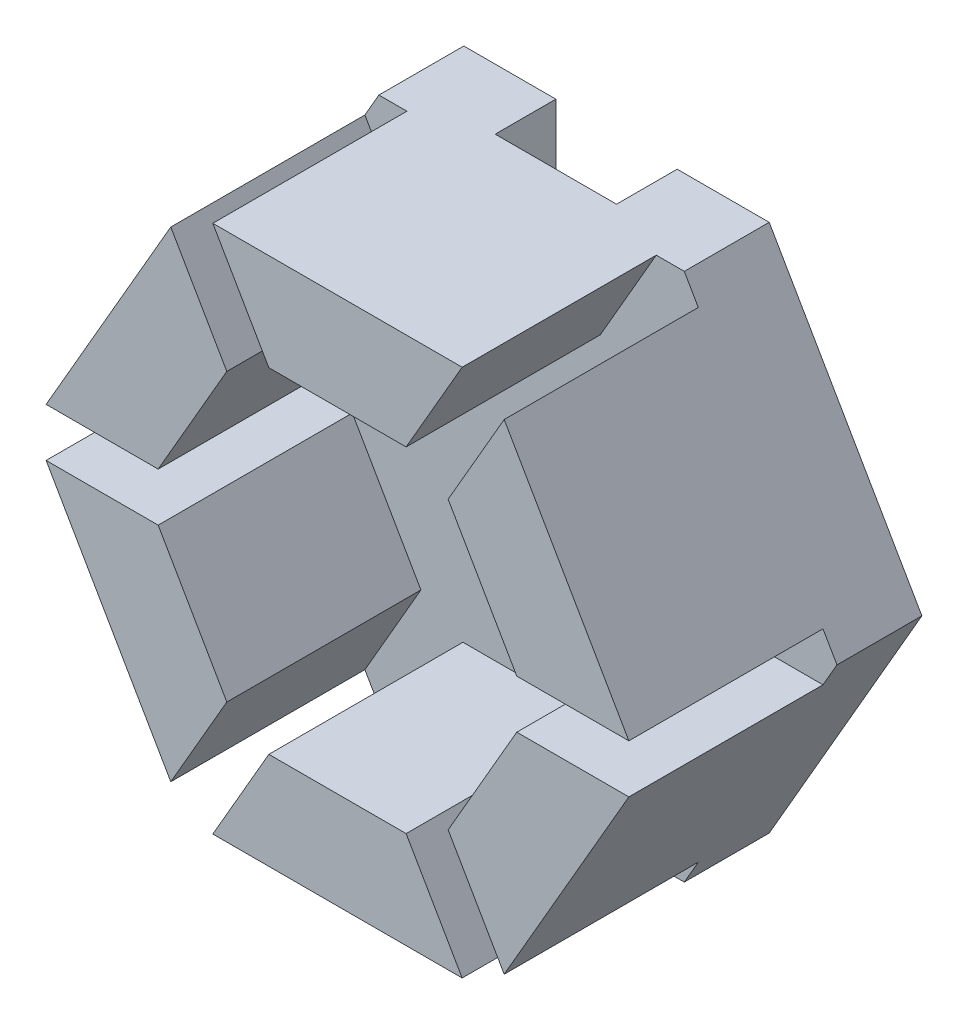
from build123d import *

# Parameters (mm, degrees)
BOSS_EXTRU_1_DEPTH      = 4
BOSS_EXTRU_2_DEPTH      = 1.75
ESQUISSE4_W             = 2.5
ESQUISSE4_H             = 10.9
ENL_V_MAT_EXTRU_1_DEPTH = 1.25
ENL_V_MAT_EXTRU_2_DEPTH = 4


with BuildPart() as part:
    # Esquisse1 → Boss.-Extru.1 (new body)
    with BuildSketch(Plane.XY):
        Polygon((3.146558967, 5.45), (-3.146558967, 5.45), (-6.293117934, 0), (-3.146558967, -5.45), (3.146558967, -5.45), (6.293117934, 0), align=None)
        Polygon((3.983716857, 0), (1.991858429, 3.45), (-1.991858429, 3.45), (-3.983716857, 0), (-1.991858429, -3.45), (1.991858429, -3.45), align=None, mode=Mode.SUBTRACT)
    extrude(amount=BOSS_EXTRU_1_DEPTH)

    # Esquisse2 → Boss.-Extru.2 (add)
    with BuildSketch(Plane(origin=(0, 0, 0), x_dir=(-1, 0, 0), z_dir=(0, 0, -1))):
        Polygon((-3.146558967, 5.45), (-6.293117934, 0), (-3.146558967, -5.45), (3.146558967, -5.45), (6.293117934, 0), (3.146558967, 5.45), align=None)
    extrude(amount=BOSS_EXTRU_2_DEPTH)

    # Esquisse4 → Enl_v. mat.-Extru.1 (cut)
    with BuildSketch(Plane(origin=(0, 0, -1.75), x_dir=(-1, 0, 0), z_dir=(0, 0, -1))):
        Rectangle(ESQUISSE4_W, ESQUISSE4_H)
    extrude(amount=-ENL_V_MAT_EXTRU_1_DEPTH, mode=Mode.SUBTRACT)

    # Esquisse5 → Enl_v. mat.-Extru.2 (cut)
    with BuildSketch(Plane.XY.offset(4)):
        Polygon((-6.0044428, 0.5), (-3.695041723, 0.5), (-3.983716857, 0), (-3.695041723, -0.5), (-6.0044428, -0.5), (-6.293117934, 0), align=None)
        Polygon((-2.569208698, 5.45), (-1.41450816, 3.45), (-1.991858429, 3.45), (-2.280533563, 2.95), (-3.435234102, 4.95), (-3.146558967, 5.45), align=None)
        Polygon((3.435234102, 4.95), (2.280533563, 2.95), (1.991858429, 3.45), (1.41450816, 3.45), (2.569208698, 5.45), (3.146558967, 5.45), align=None)
        Polygon((6.0044428, -0.5), (3.695041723, -0.5), (3.983716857, 0), (3.695041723, 0.5), (6.0044428, 0.5), (6.293117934, 0), align=None)
        Polygon((2.569208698, -5.45), (1.41450816, -3.45), (1.991858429, -3.45), (2.280533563, -2.95), (3.435234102, -4.95), (3.146558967, -5.45), align=None)
        Polygon((-3.435234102, -4.95), (-2.280533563, -2.95), (-1.991858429, -3.45), (-1.41450816, -3.45), (-2.569208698, -5.45), (-3.146558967, -5.45), align=None)
    extrude(amount=-ENL_V_MAT_EXTRU_2_DEPTH, mode=Mode.SUBTRACT)


solid = part.part
